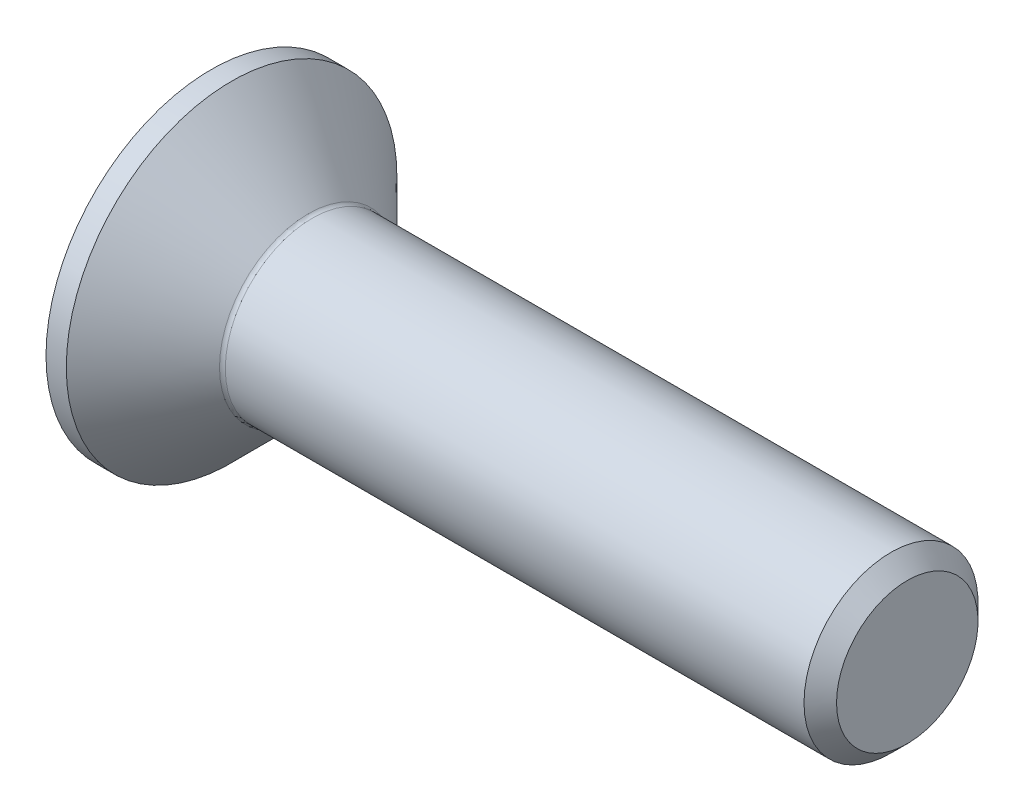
ISO-10303-21;
HEADER;
FILE_DESCRIPTION(('STEP AP214'),'2;1');
FILE_NAME('part.step','',(''),(''),'','','');
FILE_SCHEMA(('AUTOMOTIVE_DESIGN { 1 0 10303 214 1 1 1 1 }'));
ENDSEC;
DATA;
#1=APPLICATION_CONTEXT('core data for automotive mechanical design processes');
#2=APPLICATION_PROTOCOL_DEFINITION('international standard','automotive_design',2000,#1);
#3=PRODUCT_CONTEXT('',#1,'mechanical');
#4=PRODUCT('Part','Part','',(#3));
#5=PRODUCT_RELATED_PRODUCT_CATEGORY('part','',(#4));
#6=PRODUCT_DEFINITION_FORMATION('','',#4);
#7=PRODUCT_DEFINITION_CONTEXT('part definition',#1,'design');
#8=PRODUCT_DEFINITION('design','',#6,#7);
#9=PRODUCT_DEFINITION_SHAPE('','',#8);
#10=(LENGTH_UNIT() NAMED_UNIT(*) SI_UNIT(.MILLI.,.METRE.));
#11=(NAMED_UNIT(*) PLANE_ANGLE_UNIT() SI_UNIT($,.RADIAN.));
#12=(NAMED_UNIT(*) SI_UNIT($,.STERADIAN.) SOLID_ANGLE_UNIT());
#13=UNCERTAINTY_MEASURE_WITH_UNIT(LENGTH_MEASURE(1.E-05),#10,'distance_accuracy_value','');
#14=(GEOMETRIC_REPRESENTATION_CONTEXT(3) GLOBAL_UNCERTAINTY_ASSIGNED_CONTEXT((#13)) GLOBAL_UNIT_ASSIGNED_CONTEXT((#10,
#11,#12)) REPRESENTATION_CONTEXT('',''));
#15=CARTESIAN_POINT('',(0.,0.,0.));
#16=DIRECTION('',(0.,0.,1.));
#17=DIRECTION('',(1.,0.,0.));
#18=AXIS2_PLACEMENT_3D('',#15,#16,#17);
#19=CARTESIAN_POINT('',(1.20000000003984,0.,0.));
#20=DIRECTION('',(-1.,0.,0.));
#21=DIRECTION('',(0.,0.,1.));
#22=AXIS2_PLACEMENT_3D('',#19,#20,#21);
#23=CONICAL_SURFACE('',#22,1.00999999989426,1.04719755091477);
#24=CARTESIAN_POINT('',(1.78312377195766,0.,-2.27373675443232E-10));
#25=VERTEX_POINT('',#24);
#26=VERTEX_LOOP('',#25);
#27=FACE_BOUND('',#26,.T.);
#28=CARTESIAN_POINT('',(1.1999999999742,0.,0.));
#29=DIRECTION('',(-1.,0.,0.));
#30=DIRECTION('',(0.,0.,1.));
#31=AXIS2_PLACEMENT_3D('',#28,#29,#30);
#32=CIRCLE('',#31,1.01000000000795);
#33=CARTESIAN_POINT('',(1.1999999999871,0.874685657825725,-0.505000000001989));
#34=VERTEX_POINT('',#33);
#35=CARTESIAN_POINT('',(1.1999999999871,1.24825205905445E-12,-1.01000000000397));
#36=VERTEX_POINT('',#35);
#37=EDGE_CURVE('E91',#34,#36,#32,.T.);
#38=ORIENTED_EDGE('',*,*,#37,.T.);
#39=CARTESIAN_POINT('',(1.1999999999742,0.,0.));
#40=DIRECTION('',(-1.,0.,0.));
#41=DIRECTION('',(0.,0.,1.));
#42=AXIS2_PLACEMENT_3D('',#39,#40,#41);
#43=CIRCLE('',#42,1.01000000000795);
#44=CARTESIAN_POINT('',(1.1999999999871,-0.874685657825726,-0.505000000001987));
#45=VERTEX_POINT('',#44);
#46=EDGE_CURVE('E87',#36,#45,#43,.T.);
#47=ORIENTED_EDGE('',*,*,#46,.T.);
#48=CARTESIAN_POINT('',(1.1999999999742,0.,0.));
#49=DIRECTION('',(-1.,0.,0.));
#50=DIRECTION('',(0.,0.,1.));
#51=AXIS2_PLACEMENT_3D('',#48,#49,#50);
#52=CIRCLE('',#51,1.01000000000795);
#53=CARTESIAN_POINT('',(1.1999999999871,-0.874685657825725,0.505000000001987));
#54=VERTEX_POINT('',#53);
#55=EDGE_CURVE('E20',#45,#54,#52,.T.);
#56=ORIENTED_EDGE('',*,*,#55,.T.);
#57=CARTESIAN_POINT('',(1.1999999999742,0.,0.));
#58=DIRECTION('',(-1.,0.,0.));
#59=DIRECTION('',(0.,0.,1.));
#60=AXIS2_PLACEMENT_3D('',#57,#58,#59);
#61=CIRCLE('',#60,1.01000000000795);
#62=CARTESIAN_POINT('',(1.1999999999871,0.,1.01000000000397));
#63=VERTEX_POINT('',#62);
#64=EDGE_CURVE('E146',#54,#63,#61,.T.);
#65=ORIENTED_EDGE('',*,*,#64,.T.);
#66=CARTESIAN_POINT('',(1.1999999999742,0.,0.));
#67=DIRECTION('',(-1.,0.,0.));
#68=DIRECTION('',(0.,0.,1.));
#69=AXIS2_PLACEMENT_3D('',#66,#67,#68);
#70=CIRCLE('',#69,1.01000000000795);
#71=CARTESIAN_POINT('',(1.1999999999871,0.874685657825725,0.50500000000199));
#72=VERTEX_POINT('',#71);
#73=EDGE_CURVE('E148',#63,#72,#70,.T.);
#74=ORIENTED_EDGE('',*,*,#73,.T.);
#75=CARTESIAN_POINT('',(1.1999999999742,0.,0.));
#76=DIRECTION('',(-1.,0.,0.));
#77=DIRECTION('',(0.,0.,1.));
#78=AXIS2_PLACEMENT_3D('',#75,#76,#77);
#79=CIRCLE('',#78,1.01000000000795);
#80=EDGE_CURVE('E150',#72,#34,#79,.T.);
#81=ORIENTED_EDGE('',*,*,#80,.T.);
#82=EDGE_LOOP('',(#38,#47,#56,#65,#74,#81));
#83=FACE_BOUND('',#82,.T.);
#84=ADVANCED_FACE('F17',(#27,#83),#23,.F.);
#85=CARTESIAN_POINT('',(1.2,-0.583123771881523,-1.01));
#86=DIRECTION('',(1.,0.,0.));
#87=DIRECTION('',(0.,0.,-1.));
#88=AXIS2_PLACEMENT_3D('',#85,#86,#87);
#89=PLANE('',#88);
#90=DIRECTION('',(0.,0.5,0.866025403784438));
#91=VECTOR('',#90,1.);
#92=CARTESIAN_POINT('',(1.2,-0.583123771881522,1.01));
#93=LINE('',#92,#91);
#94=CARTESIAN_POINT('',(1.2,-1.16624754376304,0.));
#95=VERTEX_POINT('',#94);
#96=EDGE_CURVE('E103',#54,#95,#93,.F.);
#97=ORIENTED_EDGE('',*,*,#96,.F.);
#98=ORIENTED_EDGE('',*,*,#55,.F.);
#99=DIRECTION('',(0.,-0.499999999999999,0.866025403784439));
#100=VECTOR('',#99,1.);
#101=CARTESIAN_POINT('',(1.2,-1.16624754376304,0.));
#102=LINE('',#101,#100);
#103=EDGE_CURVE('E101',#95,#45,#102,.F.);
#104=ORIENTED_EDGE('',*,*,#103,.F.);
#105=EDGE_LOOP('',(#97,#98,#104));
#106=FACE_BOUND('',#105,.T.);
#107=ADVANCED_FACE('F99',(#106),#89,.F.);
#108=CARTESIAN_POINT('',(1.2,-0.583123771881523,-1.01));
#109=DIRECTION('',(1.,0.,0.));
#110=DIRECTION('',(0.,0.,-1.));
#111=AXIS2_PLACEMENT_3D('',#108,#109,#110);
#112=PLANE('',#111);
#113=DIRECTION('',(0.,-0.499999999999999,0.866025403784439));
#114=VECTOR('',#113,1.);
#115=CARTESIAN_POINT('',(1.2,-1.16624754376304,0.));
#116=LINE('',#115,#114);
#117=CARTESIAN_POINT('',(1.2,-0.583123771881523,-1.01));
#118=VERTEX_POINT('',#117);
#119=EDGE_CURVE('E105',#45,#118,#116,.F.);
#120=ORIENTED_EDGE('',*,*,#119,.F.);
#121=ORIENTED_EDGE('',*,*,#46,.F.);
#122=DIRECTION('',(0.,-1.,0.));
#123=VECTOR('',#122,1.);
#124=CARTESIAN_POINT('',(1.2,-0.583123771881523,-1.01));
#125=LINE('',#124,#123);
#126=EDGE_CURVE('E108',#118,#36,#125,.F.);
#127=ORIENTED_EDGE('',*,*,#126,.F.);
#128=EDGE_LOOP('',(#120,#121,#127));
#129=FACE_BOUND('',#128,.T.);
#130=ADVANCED_FACE('F106',(#129),#112,.F.);
#131=CARTESIAN_POINT('',(1.2,-0.583123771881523,-1.01));
#132=DIRECTION('',(1.,0.,0.));
#133=DIRECTION('',(0.,0.,-1.));
#134=AXIS2_PLACEMENT_3D('',#131,#132,#133);
#135=PLANE('',#134);
#136=DIRECTION('',(0.,-1.,0.));
#137=VECTOR('',#136,1.);
#138=CARTESIAN_POINT('',(1.2,-0.583123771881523,-1.01));
#139=LINE('',#138,#137);
#140=CARTESIAN_POINT('',(1.2,0.583123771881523,-1.01));
#141=VERTEX_POINT('',#140);
#142=EDGE_CURVE('E164',#36,#141,#139,.F.);
#143=ORIENTED_EDGE('',*,*,#142,.F.);
#144=ORIENTED_EDGE('',*,*,#37,.F.);
#145=DIRECTION('',(0.,-0.500000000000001,-0.866025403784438));
#146=VECTOR('',#145,1.);
#147=CARTESIAN_POINT('',(1.2,0.583123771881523,-1.01));
#148=LINE('',#147,#146);
#149=EDGE_CURVE('E162',#141,#34,#148,.F.);
#150=ORIENTED_EDGE('',*,*,#149,.F.);
#151=EDGE_LOOP('',(#143,#144,#150));
#152=FACE_BOUND('',#151,.T.);
#153=ADVANCED_FACE('F160',(#152),#135,.F.);
#154=CARTESIAN_POINT('',(1.2,-0.583123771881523,-1.01));
#155=DIRECTION('',(1.,0.,0.));
#156=DIRECTION('',(0.,0.,-1.));
#157=AXIS2_PLACEMENT_3D('',#154,#155,#156);
#158=PLANE('',#157);
#159=DIRECTION('',(0.,-0.500000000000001,-0.866025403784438));
#160=VECTOR('',#159,1.);
#161=CARTESIAN_POINT('',(1.2,0.583123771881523,-1.01));
#162=LINE('',#161,#160);
#163=CARTESIAN_POINT('',(1.2,1.16624754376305,0.));
#164=VERTEX_POINT('',#163);
#165=EDGE_CURVE('E165',#34,#164,#162,.F.);
#166=ORIENTED_EDGE('',*,*,#165,.F.);
#167=ORIENTED_EDGE('',*,*,#80,.F.);
#168=DIRECTION('',(0.,0.500000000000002,-0.866025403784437));
#169=VECTOR('',#168,1.);
#170=CARTESIAN_POINT('',(1.2,1.16624754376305,0.));
#171=LINE('',#170,#169);
#172=EDGE_CURVE('E168',#164,#72,#171,.F.);
#173=ORIENTED_EDGE('',*,*,#172,.F.);
#174=EDGE_LOOP('',(#166,#167,#173));
#175=FACE_BOUND('',#174,.T.);
#176=ADVANCED_FACE('F166',(#175),#158,.F.);
#177=CARTESIAN_POINT('',(1.2,-0.583123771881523,-1.01));
#178=DIRECTION('',(1.,0.,0.));
#179=DIRECTION('',(0.,0.,-1.));
#180=AXIS2_PLACEMENT_3D('',#177,#178,#179);
#181=PLANE('',#180);
#182=DIRECTION('',(0.,0.500000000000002,-0.866025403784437));
#183=VECTOR('',#182,1.);
#184=CARTESIAN_POINT('',(1.2,1.16624754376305,0.));
#185=LINE('',#184,#183);
#186=CARTESIAN_POINT('',(1.2,0.583123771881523,1.01));
#187=VERTEX_POINT('',#186);
#188=EDGE_CURVE('E224',#72,#187,#185,.F.);
#189=ORIENTED_EDGE('',*,*,#188,.F.);
#190=ORIENTED_EDGE('',*,*,#73,.F.);
#191=DIRECTION('',(0.,1.,0.));
#192=VECTOR('',#191,1.);
#193=CARTESIAN_POINT('',(1.2,0.583123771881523,1.01));
#194=LINE('',#193,#192);
#195=EDGE_CURVE('E236',#187,#63,#194,.F.);
#196=ORIENTED_EDGE('',*,*,#195,.F.);
#197=EDGE_LOOP('',(#189,#190,#196));
#198=FACE_BOUND('',#197,.T.);
#199=ADVANCED_FACE('F304',(#198),#181,.F.);
#200=CARTESIAN_POINT('',(1.2,-0.583123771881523,-1.01));
#201=DIRECTION('',(1.,0.,0.));
#202=DIRECTION('',(0.,0.,-1.));
#203=AXIS2_PLACEMENT_3D('',#200,#201,#202);
#204=PLANE('',#203);
#205=DIRECTION('',(0.,1.,0.));
#206=VECTOR('',#205,1.);
#207=CARTESIAN_POINT('',(1.2,0.583123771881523,1.01));
#208=LINE('',#207,#206);
#209=CARTESIAN_POINT('',(1.2,-0.583123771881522,1.01));
#210=VERTEX_POINT('',#209);
#211=EDGE_CURVE('E244',#63,#210,#208,.F.);
#212=ORIENTED_EDGE('',*,*,#211,.F.);
#213=ORIENTED_EDGE('',*,*,#64,.F.);
#214=DIRECTION('',(0.,0.5,0.866025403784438));
#215=VECTOR('',#214,1.);
#216=CARTESIAN_POINT('',(1.2,-0.583123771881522,1.01));
#217=LINE('',#216,#215);
#218=EDGE_CURVE('E127',#210,#54,#217,.F.);
#219=ORIENTED_EDGE('',*,*,#218,.F.);
#220=EDGE_LOOP('',(#212,#213,#219));
#221=FACE_BOUND('',#220,.T.);
#222=ADVANCED_FACE('F300',(#221),#204,.F.);
#223=CARTESIAN_POINT('',(1.2,-0.583123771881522,1.01));
#224=DIRECTION('',(0.,0.866025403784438,-0.5));
#225=DIRECTION('',(0.,0.5,0.866025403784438));
#226=AXIS2_PLACEMENT_3D('',#223,#224,#225);
#227=PLANE('',#226);
#228=ORIENTED_EDGE('',*,*,#96,.T.);
#229=DIRECTION('',(1.,0.,0.));
#230=VECTOR('',#229,1.);
#231=CARTESIAN_POINT('',(1.2,-1.16624754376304,0.));
#232=LINE('',#231,#230);
#233=CARTESIAN_POINT('',(0.,-1.16624754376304,0.));
#234=VERTEX_POINT('',#233);
#235=EDGE_CURVE('E115',#234,#95,#232,.T.);
#236=ORIENTED_EDGE('',*,*,#235,.F.);
#237=DIRECTION('',(0.,-0.5,-0.866025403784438));
#238=VECTOR('',#237,1.);
#239=CARTESIAN_POINT('',(0.,-0.583123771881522,1.01));
#240=LINE('',#239,#238);
#241=CARTESIAN_POINT('',(0.,-0.583123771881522,1.01));
#242=VERTEX_POINT('',#241);
#243=EDGE_CURVE('E130',#242,#234,#240,.T.);
#244=ORIENTED_EDGE('',*,*,#243,.F.);
#245=DIRECTION('',(-1.,0.,0.));
#246=VECTOR('',#245,1.);
#247=CARTESIAN_POINT('',(1.2,-0.583123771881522,1.01));
#248=LINE('',#247,#246);
#249=EDGE_CURVE('E134',#210,#242,#248,.T.);
#250=ORIENTED_EDGE('',*,*,#249,.F.);
#251=ORIENTED_EDGE('',*,*,#218,.T.);
#252=EDGE_LOOP('',(#228,#236,#244,#250,#251));
#253=FACE_BOUND('',#252,.T.);
#254=ADVANCED_FACE('F297',(#253),#227,.T.);
#255=CARTESIAN_POINT('',(1.2,-1.16624754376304,0.));
#256=DIRECTION('',(0.,0.866025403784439,0.499999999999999));
#257=DIRECTION('',(0.,-0.499999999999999,0.866025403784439));
#258=AXIS2_PLACEMENT_3D('',#255,#256,#257);
#259=PLANE('',#258);
#260=ORIENTED_EDGE('',*,*,#119,.T.);
#261=DIRECTION('',(1.,0.,0.));
#262=VECTOR('',#261,1.);
#263=CARTESIAN_POINT('',(1.2,-0.583123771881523,-1.01));
#264=LINE('',#263,#262);
#265=CARTESIAN_POINT('',(0.,-0.583123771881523,-1.01));
#266=VERTEX_POINT('',#265);
#267=EDGE_CURVE('E111',#266,#118,#264,.T.);
#268=ORIENTED_EDGE('',*,*,#267,.F.);
#269=DIRECTION('',(0.,0.5,-0.866025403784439));
#270=VECTOR('',#269,1.);
#271=CARTESIAN_POINT('',(0.,-1.16624754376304,0.));
#272=LINE('',#271,#270);
#273=EDGE_CURVE('E133',#234,#266,#272,.T.);
#274=ORIENTED_EDGE('',*,*,#273,.F.);
#275=ORIENTED_EDGE('',*,*,#235,.T.);
#276=ORIENTED_EDGE('',*,*,#103,.T.);
#277=EDGE_LOOP('',(#260,#268,#274,#275,#276));
#278=FACE_BOUND('',#277,.T.);
#279=ADVANCED_FACE('F113',(#278),#259,.T.);
#280=CARTESIAN_POINT('',(1.2,-0.583123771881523,-1.01));
#281=DIRECTION('',(0.,0.,1.));
#282=DIRECTION('',(0.,-1.,0.));
#283=AXIS2_PLACEMENT_3D('',#280,#281,#282);
#284=PLANE('',#283);
#285=ORIENTED_EDGE('',*,*,#142,.T.);
#286=DIRECTION('',(1.,0.,0.));
#287=VECTOR('',#286,1.);
#288=CARTESIAN_POINT('',(1.2,0.583123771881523,-1.01));
#289=LINE('',#288,#287);
#290=CARTESIAN_POINT('',(0.,0.583123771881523,-1.01));
#291=VERTEX_POINT('',#290);
#292=EDGE_CURVE('E175',#291,#141,#289,.T.);
#293=ORIENTED_EDGE('',*,*,#292,.F.);
#294=DIRECTION('',(0.,1.,0.));
#295=VECTOR('',#294,1.);
#296=CARTESIAN_POINT('',(0.,0.,-1.01));
#297=LINE('',#296,#295);
#298=EDGE_CURVE('E189',#266,#291,#297,.T.);
#299=ORIENTED_EDGE('',*,*,#298,.F.);
#300=ORIENTED_EDGE('',*,*,#267,.T.);
#301=ORIENTED_EDGE('',*,*,#126,.T.);
#302=EDGE_LOOP('',(#285,#293,#299,#300,#301));
#303=FACE_BOUND('',#302,.T.);
#304=ADVANCED_FACE('F212',(#303),#284,.T.);
#305=CARTESIAN_POINT('',(1.2,0.583123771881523,-1.01));
#306=DIRECTION('',(0.,-0.866025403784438,0.500000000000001));
#307=DIRECTION('',(0.,-0.500000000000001,-0.866025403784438));
#308=AXIS2_PLACEMENT_3D('',#305,#306,#307);
#309=PLANE('',#308);
#310=ORIENTED_EDGE('',*,*,#165,.T.);
#311=DIRECTION('',(1.,0.,0.));
#312=VECTOR('',#311,1.);
#313=CARTESIAN_POINT('',(1.2,1.16624754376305,0.));
#314=LINE('',#313,#312);
#315=CARTESIAN_POINT('',(0.,1.16624754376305,0.));
#316=VERTEX_POINT('',#315);
#317=EDGE_CURVE('E171',#316,#164,#314,.T.);
#318=ORIENTED_EDGE('',*,*,#317,.F.);
#319=DIRECTION('',(0.,0.500000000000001,0.866025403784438));
#320=VECTOR('',#319,1.);
#321=CARTESIAN_POINT('',(0.,0.583123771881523,-1.01));
#322=LINE('',#321,#320);
#323=EDGE_CURVE('E192',#291,#316,#322,.T.);
#324=ORIENTED_EDGE('',*,*,#323,.F.);
#325=ORIENTED_EDGE('',*,*,#292,.T.);
#326=ORIENTED_EDGE('',*,*,#149,.T.);
#327=EDGE_LOOP('',(#310,#318,#324,#325,#326));
#328=FACE_BOUND('',#327,.T.);
#329=ADVANCED_FACE('F173',(#328),#309,.T.);
#330=CARTESIAN_POINT('',(1.2,1.16624754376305,0.));
#331=DIRECTION('',(0.,-0.866025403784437,-0.500000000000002));
#332=DIRECTION('',(0.,0.500000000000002,-0.866025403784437));
#333=AXIS2_PLACEMENT_3D('',#330,#331,#332);
#334=PLANE('',#333);
#335=ORIENTED_EDGE('',*,*,#188,.T.);
#336=DIRECTION('',(-1.,0.,0.));
#337=VECTOR('',#336,1.);
#338=CARTESIAN_POINT('',(1.2,0.583123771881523,1.01));
#339=LINE('',#338,#337);
#340=CARTESIAN_POINT('',(0.,0.583123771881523,1.01));
#341=VERTEX_POINT('',#340);
#342=EDGE_CURVE('E35',#341,#187,#339,.F.);
#343=ORIENTED_EDGE('',*,*,#342,.F.);
#344=DIRECTION('',(0.,-0.500000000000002,0.866025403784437));
#345=VECTOR('',#344,1.);
#346=CARTESIAN_POINT('',(0.,1.16624754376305,0.));
#347=LINE('',#346,#345);
#348=EDGE_CURVE('E213',#316,#341,#347,.T.);
#349=ORIENTED_EDGE('',*,*,#348,.F.);
#350=ORIENTED_EDGE('',*,*,#317,.T.);
#351=ORIENTED_EDGE('',*,*,#172,.T.);
#352=EDGE_LOOP('',(#335,#343,#349,#350,#351));
#353=FACE_BOUND('',#352,.T.);
#354=ADVANCED_FACE('F287',(#353),#334,.T.);
#355=CARTESIAN_POINT('',(1.2,0.583123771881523,1.01));
#356=DIRECTION('',(0.,0.,-1.));
#357=DIRECTION('',(-1.,0.,0.));
#358=AXIS2_PLACEMENT_3D('',#355,#356,#357);
#359=PLANE('',#358);
#360=ORIENTED_EDGE('',*,*,#211,.T.);
#361=ORIENTED_EDGE('',*,*,#249,.T.);
#362=DIRECTION('',(0.,1.,0.));
#363=VECTOR('',#362,1.);
#364=CARTESIAN_POINT('',(0.,0.,1.01));
#365=LINE('',#364,#363);
#366=EDGE_CURVE('E145',#341,#242,#365,.F.);
#367=ORIENTED_EDGE('',*,*,#366,.F.);
#368=ORIENTED_EDGE('',*,*,#342,.T.);
#369=ORIENTED_EDGE('',*,*,#195,.T.);
#370=EDGE_LOOP('',(#360,#361,#367,#368,#369));
#371=FACE_BOUND('',#370,.T.);
#372=ADVANCED_FACE('F284',(#371),#359,.T.);
#373=CARTESIAN_POINT('',(0.,0.,0.));
#374=DIRECTION('',(-1.,0.,0.));
#375=DIRECTION('',(0.,0.,1.));
#376=AXIS2_PLACEMENT_3D('',#373,#374,#375);
#377=PLANE('',#376);
#378=ORIENTED_EDGE('',*,*,#348,.T.);
#379=ORIENTED_EDGE('',*,*,#366,.T.);
#380=ORIENTED_EDGE('',*,*,#243,.T.);
#381=ORIENTED_EDGE('',*,*,#273,.T.);
#382=ORIENTED_EDGE('',*,*,#298,.T.);
#383=ORIENTED_EDGE('',*,*,#323,.T.);
#384=EDGE_LOOP('',(#378,#379,#380,#381,#382,#383));
#385=FACE_BOUND('',#384,.T.);
#386=CARTESIAN_POINT('',(0.,0.,0.));
#387=DIRECTION('',(-1.,0.,0.));
#388=DIRECTION('',(0.,0.,1.));
#389=AXIS2_PLACEMENT_3D('',#386,#387,#388);
#390=CIRCLE('',#389,2.85);
#391=CARTESIAN_POINT('',(0.,0.,2.85));
#392=VERTEX_POINT('',#391);
#393=EDGE_CURVE('E142',#392,#392,#390,.F.);
#394=ORIENTED_EDGE('',*,*,#393,.F.);
#395=EDGE_LOOP('',(#394));
#396=FACE_BOUND('',#395,.T.);
#397=ADVANCED_FACE('F205',(#385,#396),#377,.T.);
#398=CARTESIAN_POINT('',(0.,0.,0.));
#399=DIRECTION('',(-1.,0.,0.));
#400=DIRECTION('',(0.,0.,1.));
#401=AXIS2_PLACEMENT_3D('',#398,#399,#400);
#402=CYLINDRICAL_SURFACE('',#401,2.85);
#403=ORIENTED_EDGE('',*,*,#393,.T.);
#404=EDGE_LOOP('',(#403));
#405=FACE_BOUND('',#404,.T.);
#406=CARTESIAN_POINT('',(0.349999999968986,0.,0.));
#407=DIRECTION('',(-1.,0.,0.));
#408=DIRECTION('',(0.,0.,1.));
#409=AXIS2_PLACEMENT_3D('',#406,#407,#408);
#410=CIRCLE('',#409,2.84999999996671);
#411=CARTESIAN_POINT('',(0.349999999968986,0.,2.84999999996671));
#412=VERTEX_POINT('',#411);
#413=EDGE_CURVE('E141',#412,#412,#410,.F.);
#414=ORIENTED_EDGE('',*,*,#413,.F.);
#415=EDGE_LOOP('',(#414));
#416=FACE_BOUND('',#415,.T.);
#417=ADVANCED_FACE('F277',(#405,#416),#402,.T.);
#418=CARTESIAN_POINT('',(12.,1.2195,0.));
#419=DIRECTION('',(1.,0.,0.));
#420=DIRECTION('',(0.,0.,-1.));
#421=AXIS2_PLACEMENT_3D('',#418,#419,#420);
#422=PLANE('',#421);
#423=CARTESIAN_POINT('',(11.9999999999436,0.,0.));
#424=DIRECTION('',(-1.,0.,0.));
#425=DIRECTION('',(0.,0.,1.));
#426=AXIS2_PLACEMENT_3D('',#423,#424,#425);
#427=CIRCLE('',#426,1.2194999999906);
#428=CARTESIAN_POINT('',(11.9999999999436,0.,1.2194999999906));
#429=VERTEX_POINT('',#428);
#430=EDGE_CURVE('E137',#429,#429,#427,.T.);
#431=ORIENTED_EDGE('',*,*,#430,.F.);
#432=EDGE_LOOP('',(#431));
#433=FACE_BOUND('',#432,.T.);
#434=ADVANCED_FACE('F273',(#433),#422,.T.);
#435=CARTESIAN_POINT('',(0.349999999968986,0.,0.));
#436=DIRECTION('',(-1.,0.,0.));
#437=DIRECTION('',(0.,0.,1.));
#438=AXIS2_PLACEMENT_3D('',#435,#436,#437);
#439=CONICAL_SURFACE('',#438,2.84999999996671,0.785398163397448);
#440=ORIENTED_EDGE('',*,*,#413,.T.);
#441=EDGE_LOOP('',(#440));
#442=FACE_BOUND('',#441,.T.);
#443=CARTESIAN_POINT('',(1.67071067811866,0.,0.));
#444=DIRECTION('',(-1.,0.,0.));
#445=DIRECTION('',(0.,0.,1.));
#446=AXIS2_PLACEMENT_3D('',#443,#444,#445);
#447=CIRCLE('',#446,1.52928932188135);
#448=CARTESIAN_POINT('',(1.67071067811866,0.,1.52928932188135));
#449=VERTEX_POINT('',#448);
#450=EDGE_CURVE('E140',#449,#449,#447,.T.);
#451=ORIENTED_EDGE('',*,*,#450,.T.);
#452=EDGE_LOOP('',(#451));
#453=FACE_BOUND('',#452,.T.);
#454=ADVANCED_FACE('F269',(#442,#453),#439,.T.);
#455=CARTESIAN_POINT('',(11.7194999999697,0.,0.));
#456=DIRECTION('',(-1.,0.,0.));
#457=DIRECTION('',(0.,0.,1.));
#458=AXIS2_PLACEMENT_3D('',#455,#456,#457);
#459=CONICAL_SURFACE('',#458,1.49999999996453,0.785398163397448);
#460=CARTESIAN_POINT('',(11.7195,0.,0.));
#461=DIRECTION('',(-1.,0.,0.));
#462=DIRECTION('',(0.,0.,1.));
#463=AXIS2_PLACEMENT_3D('',#460,#461,#462);
#464=CIRCLE('',#463,1.5);
#465=CARTESIAN_POINT('',(11.7195,0.,1.5));
#466=VERTEX_POINT('',#465);
#467=EDGE_CURVE('E26',#466,#466,#464,.T.);
#468=ORIENTED_EDGE('',*,*,#467,.F.);
#469=EDGE_LOOP('',(#468));
#470=FACE_BOUND('',#469,.T.);
#471=ORIENTED_EDGE('',*,*,#430,.T.);
#472=EDGE_LOOP('',(#471));
#473=FACE_BOUND('',#472,.T.);
#474=ADVANCED_FACE('F265',(#470,#473),#459,.T.);
#475=CARTESIAN_POINT('',(1.74142135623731,0.,0.));
#476=DIRECTION('',(-1.,0.,0.));
#477=DIRECTION('',(0.,0.,1.));
#478=AXIS2_PLACEMENT_3D('',#475,#476,#477);
#479=TOROIDAL_SURFACE('',#478,1.6,0.1);
#480=ORIENTED_EDGE('',*,*,#450,.F.);
#481=EDGE_LOOP('',(#480));
#482=FACE_BOUND('',#481,.T.);
#483=CARTESIAN_POINT('',(1.74142135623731,0.,0.));
#484=DIRECTION('',(-1.,0.,0.));
#485=DIRECTION('',(0.,0.,1.));
#486=AXIS2_PLACEMENT_3D('',#483,#484,#485);
#487=CIRCLE('',#486,1.5);
#488=CARTESIAN_POINT('',(1.74142135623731,0.,1.5));
#489=VERTEX_POINT('',#488);
#490=EDGE_CURVE('E11',#489,#489,#487,.F.);
#491=ORIENTED_EDGE('',*,*,#490,.F.);
#492=EDGE_LOOP('',(#491));
#493=FACE_BOUND('',#492,.T.);
#494=ADVANCED_FACE('F260',(#482,#493),#479,.F.);
#495=CARTESIAN_POINT('',(0.,0.,0.));
#496=DIRECTION('',(-1.,0.,0.));
#497=DIRECTION('',(0.,0.,1.));
#498=AXIS2_PLACEMENT_3D('',#495,#496,#497);
#499=CYLINDRICAL_SURFACE('',#498,1.5);
#500=ORIENTED_EDGE('',*,*,#490,.T.);
#501=EDGE_LOOP('',(#500));
#502=FACE_BOUND('',#501,.T.);
#503=ORIENTED_EDGE('',*,*,#467,.T.);
#504=EDGE_LOOP('',(#503));
#505=FACE_BOUND('',#504,.T.);
#506=ADVANCED_FACE('F264',(#502,#505),#499,.T.);
#507=CLOSED_SHELL('',(#84,#107,#130,#153,#176,#199,#222,#254,#279,#304,#329,#354,#372,#397,#417,
#434,#454,#474,#494,#506));
#508=MANIFOLD_SOLID_BREP('B1',#507);
#509=ADVANCED_BREP_SHAPE_REPRESENTATION('',(#18,#508),#14);
#510=SHAPE_DEFINITION_REPRESENTATION(#9,#509);
ENDSEC;
END-ISO-10303-21;
